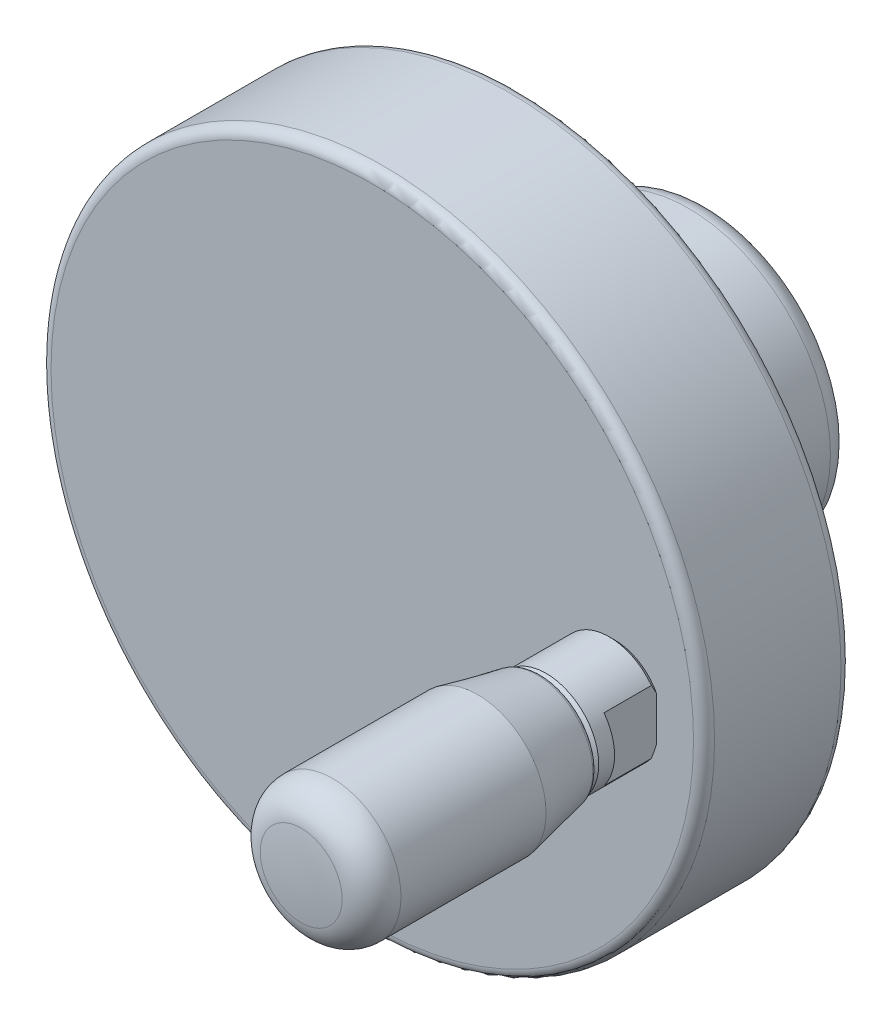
ISO-10303-21;
HEADER;
FILE_DESCRIPTION(('STEP AP214'),'2;1');
FILE_NAME('part.step','',(''),(''),'','','');
FILE_SCHEMA(('AUTOMOTIVE_DESIGN { 1 0 10303 214 1 1 1 1 }'));
ENDSEC;
DATA;
#1=APPLICATION_CONTEXT('core data for automotive mechanical design processes');
#2=APPLICATION_PROTOCOL_DEFINITION('international standard','automotive_design',2000,#1);
#3=PRODUCT_CONTEXT('',#1,'mechanical');
#4=PRODUCT('Part','Part','',(#3));
#5=PRODUCT_RELATED_PRODUCT_CATEGORY('part','',(#4));
#6=PRODUCT_DEFINITION_FORMATION('','',#4);
#7=PRODUCT_DEFINITION_CONTEXT('part definition',#1,'design');
#8=PRODUCT_DEFINITION('design','',#6,#7);
#9=PRODUCT_DEFINITION_SHAPE('','',#8);
#10=(LENGTH_UNIT() NAMED_UNIT(*) SI_UNIT(.MILLI.,.METRE.));
#11=(NAMED_UNIT(*) PLANE_ANGLE_UNIT() SI_UNIT($,.RADIAN.));
#12=(NAMED_UNIT(*) SI_UNIT($,.STERADIAN.) SOLID_ANGLE_UNIT());
#13=UNCERTAINTY_MEASURE_WITH_UNIT(LENGTH_MEASURE(1.E-05),#10,'distance_accuracy_value','');
#14=(GEOMETRIC_REPRESENTATION_CONTEXT(3) GLOBAL_UNCERTAINTY_ASSIGNED_CONTEXT((#13)) GLOBAL_UNIT_ASSIGNED_CONTEXT((#10,
#11,#12)) REPRESENTATION_CONTEXT('',''));
#15=CARTESIAN_POINT('',(0.,0.,0.));
#16=DIRECTION('',(0.,0.,1.));
#17=DIRECTION('',(1.,0.,0.));
#18=AXIS2_PLACEMENT_3D('',#15,#16,#17);
#19=CARTESIAN_POINT('',(0.,6.,22.));
#20=DIRECTION('',(0.,0.,1.));
#21=DIRECTION('',(1.,0.,0.));
#22=AXIS2_PLACEMENT_3D('',#19,#20,#21);
#23=PLANE('',#22);
#24=CARTESIAN_POINT('',(0.,0.,22.));
#25=DIRECTION('',(0.,0.,1.));
#26=DIRECTION('',(1.,0.,0.));
#27=AXIS2_PLACEMENT_3D('',#24,#25,#26);
#28=CIRCLE('',#27,6.);
#29=CARTESIAN_POINT('',(6.,0.,22.));
#30=VERTEX_POINT('',#29);
#31=EDGE_CURVE('E79',#30,#30,#28,.T.);
#32=ORIENTED_EDGE('',*,*,#31,.F.);
#33=EDGE_LOOP('',(#32));
#34=FACE_BOUND('',#33,.T.);
#35=ADVANCED_FACE('F14',(#34),#23,.F.);
#36=CARTESIAN_POINT('',(0.,0.,37.));
#37=DIRECTION('',(0.,0.,1.));
#38=DIRECTION('',(1.,0.,0.));
#39=AXIS2_PLACEMENT_3D('',#36,#37,#38);
#40=CYLINDRICAL_SURFACE('',#39,6.);
#41=CARTESIAN_POINT('',(0.,0.,0.));
#42=DIRECTION('',(0.,0.,1.));
#43=DIRECTION('',(1.,0.,0.));
#44=AXIS2_PLACEMENT_3D('',#41,#42,#43);
#45=CIRCLE('',#44,6.);
#46=CARTESIAN_POINT('',(6.,0.,0.));
#47=VERTEX_POINT('',#46);
#48=EDGE_CURVE('E182',#47,#47,#45,.T.);
#49=ORIENTED_EDGE('',*,*,#48,.F.);
#50=EDGE_LOOP('',(#49));
#51=FACE_BOUND('',#50,.T.);
#52=ORIENTED_EDGE('',*,*,#31,.T.);
#53=EDGE_LOOP('',(#52));
#54=FACE_BOUND('',#53,.T.);
#55=ADVANCED_FACE('F214',(#51,#54),#40,.F.);
#56=CARTESIAN_POINT('',(0.,11.5,0.));
#57=DIRECTION('',(0.,0.,1.));
#58=DIRECTION('',(1.,0.,0.));
#59=AXIS2_PLACEMENT_3D('',#56,#57,#58);
#60=PLANE('',#59);
#61=CARTESIAN_POINT('',(0.,0.,0.));
#62=DIRECTION('',(0.,0.,1.));
#63=DIRECTION('',(1.,0.,0.));
#64=AXIS2_PLACEMENT_3D('',#61,#62,#63);
#65=CIRCLE('',#64,11.5);
#66=CARTESIAN_POINT('',(11.5,0.,0.));
#67=VERTEX_POINT('',#66);
#68=EDGE_CURVE('E179',#67,#67,#65,.T.);
#69=ORIENTED_EDGE('',*,*,#68,.F.);
#70=EDGE_LOOP('',(#69));
#71=FACE_BOUND('',#70,.T.);
#72=ORIENTED_EDGE('',*,*,#48,.T.);
#73=EDGE_LOOP('',(#72));
#74=FACE_BOUND('',#73,.T.);
#75=ADVANCED_FACE('F220',(#71,#74),#60,.F.);
#76=CARTESIAN_POINT('',(0.,0.,2.));
#77=DIRECTION('',(0.,0.,1.));
#78=DIRECTION('',(1.,0.,0.));
#79=AXIS2_PLACEMENT_3D('',#76,#77,#78);
#80=TOROIDAL_SURFACE('',#79,11.5,2.);
#81=CARTESIAN_POINT('',(0.,0.,2.));
#82=DIRECTION('',(0.,0.,1.));
#83=DIRECTION('',(1.,0.,0.));
#84=AXIS2_PLACEMENT_3D('',#81,#82,#83);
#85=CIRCLE('',#84,13.5);
#86=CARTESIAN_POINT('',(13.5,0.,2.));
#87=VERTEX_POINT('',#86);
#88=EDGE_CURVE('E176',#87,#87,#85,.T.);
#89=ORIENTED_EDGE('',*,*,#88,.F.);
#90=EDGE_LOOP('',(#89));
#91=FACE_BOUND('',#90,.T.);
#92=ORIENTED_EDGE('',*,*,#68,.T.);
#93=EDGE_LOOP('',(#92));
#94=FACE_BOUND('',#93,.T.);
#95=ADVANCED_FACE('F228',(#91,#94),#80,.T.);
#96=CARTESIAN_POINT('',(0.,0.,37.));
#97=DIRECTION('',(0.,0.,1.));
#98=DIRECTION('',(1.,0.,0.));
#99=AXIS2_PLACEMENT_3D('',#96,#97,#98);
#100=CYLINDRICAL_SURFACE('',#99,13.5);
#101=CARTESIAN_POINT('',(0.,0.,15.));
#102=DIRECTION('',(0.,0.,1.));
#103=DIRECTION('',(1.,0.,0.));
#104=AXIS2_PLACEMENT_3D('',#101,#102,#103);
#105=CIRCLE('',#104,13.5);
#106=CARTESIAN_POINT('',(13.5,0.,15.));
#107=VERTEX_POINT('',#106);
#108=EDGE_CURVE('E173',#107,#107,#105,.T.);
#109=ORIENTED_EDGE('',*,*,#108,.F.);
#110=EDGE_LOOP('',(#109));
#111=FACE_BOUND('',#110,.T.);
#112=ORIENTED_EDGE('',*,*,#88,.T.);
#113=EDGE_LOOP('',(#112));
#114=FACE_BOUND('',#113,.T.);
#115=ADVANCED_FACE('F235',(#111,#114),#100,.T.);
#116=CARTESIAN_POINT('',(0.,0.,15.));
#117=DIRECTION('',(0.,0.,1.));
#118=DIRECTION('',(1.,0.,0.));
#119=AXIS2_PLACEMENT_3D('',#116,#117,#118);
#120=TOROIDAL_SURFACE('',#119,16.5,3.);
#121=CARTESIAN_POINT('',(0.,0.,18.));
#122=DIRECTION('',(0.,0.,1.));
#123=DIRECTION('',(1.,0.,0.));
#124=AXIS2_PLACEMENT_3D('',#121,#122,#123);
#125=CIRCLE('',#124,16.5);
#126=CARTESIAN_POINT('',(16.5,0.,18.));
#127=VERTEX_POINT('',#126);
#128=EDGE_CURVE('E170',#127,#127,#125,.T.);
#129=ORIENTED_EDGE('',*,*,#128,.F.);
#130=EDGE_LOOP('',(#129));
#131=FACE_BOUND('',#130,.T.);
#132=ORIENTED_EDGE('',*,*,#108,.T.);
#133=EDGE_LOOP('',(#132));
#134=FACE_BOUND('',#133,.T.);
#135=ADVANCED_FACE('F239',(#131,#134),#120,.F.);
#136=CARTESIAN_POINT('',(0.,30.5,18.));
#137=DIRECTION('',(0.,0.,1.));
#138=DIRECTION('',(1.,0.,0.));
#139=AXIS2_PLACEMENT_3D('',#136,#137,#138);
#140=PLANE('',#139);
#141=CARTESIAN_POINT('',(0.,0.,18.));
#142=DIRECTION('',(0.,0.,1.));
#143=DIRECTION('',(1.,0.,0.));
#144=AXIS2_PLACEMENT_3D('',#141,#142,#143);
#145=CIRCLE('',#144,30.5);
#146=CARTESIAN_POINT('',(30.5,0.,18.));
#147=VERTEX_POINT('',#146);
#148=EDGE_CURVE('E167',#147,#147,#145,.T.);
#149=ORIENTED_EDGE('',*,*,#148,.F.);
#150=EDGE_LOOP('',(#149));
#151=FACE_BOUND('',#150,.T.);
#152=ORIENTED_EDGE('',*,*,#128,.T.);
#153=EDGE_LOOP('',(#152));
#154=FACE_BOUND('',#153,.T.);
#155=ADVANCED_FACE('F243',(#151,#154),#140,.F.);
#156=CARTESIAN_POINT('',(0.,0.,19.));
#157=DIRECTION('',(0.,0.,1.));
#158=DIRECTION('',(1.,0.,0.));
#159=AXIS2_PLACEMENT_3D('',#156,#157,#158);
#160=TOROIDAL_SURFACE('',#159,30.5,1.);
#161=CARTESIAN_POINT('',(0.,0.,19.));
#162=DIRECTION('',(0.,0.,1.));
#163=DIRECTION('',(1.,0.,0.));
#164=AXIS2_PLACEMENT_3D('',#161,#162,#163);
#165=CIRCLE('',#164,31.5);
#166=CARTESIAN_POINT('',(31.5,0.,19.));
#167=VERTEX_POINT('',#166);
#168=EDGE_CURVE('E162',#167,#167,#165,.T.);
#169=ORIENTED_EDGE('',*,*,#168,.F.);
#170=EDGE_LOOP('',(#169));
#171=FACE_BOUND('',#170,.T.);
#172=ORIENTED_EDGE('',*,*,#148,.T.);
#173=EDGE_LOOP('',(#172));
#174=FACE_BOUND('',#173,.T.);
#175=ADVANCED_FACE('F247',(#171,#174),#160,.T.);
#176=CARTESIAN_POINT('',(0.,0.,37.));
#177=DIRECTION('',(0.,0.,1.));
#178=DIRECTION('',(1.,0.,0.));
#179=AXIS2_PLACEMENT_3D('',#176,#177,#178);
#180=CYLINDRICAL_SURFACE('',#179,31.5);
#181=CARTESIAN_POINT('',(0.,0.,31.));
#182=DIRECTION('',(0.,0.,1.));
#183=DIRECTION('',(1.,0.,0.));
#184=AXIS2_PLACEMENT_3D('',#181,#182,#183);
#185=CIRCLE('',#184,31.5);
#186=CARTESIAN_POINT('',(31.5,0.,31.));
#187=VERTEX_POINT('',#186);
#188=EDGE_CURVE('E158',#187,#187,#185,.T.);
#189=ORIENTED_EDGE('',*,*,#188,.F.);
#190=EDGE_LOOP('',(#189));
#191=FACE_BOUND('',#190,.T.);
#192=ORIENTED_EDGE('',*,*,#168,.T.);
#193=EDGE_LOOP('',(#192));
#194=FACE_BOUND('',#193,.T.);
#195=ADVANCED_FACE('F251',(#191,#194),#180,.T.);
#196=CARTESIAN_POINT('',(0.,0.,31.));
#197=DIRECTION('',(0.,0.,1.));
#198=DIRECTION('',(1.,0.,0.));
#199=AXIS2_PLACEMENT_3D('',#196,#197,#198);
#200=TOROIDAL_SURFACE('',#199,30.5,1.);
#201=CARTESIAN_POINT('',(0.,0.,32.));
#202=DIRECTION('',(0.,0.,1.));
#203=DIRECTION('',(1.,0.,0.));
#204=AXIS2_PLACEMENT_3D('',#201,#202,#203);
#205=CIRCLE('',#204,30.5);
#206=CARTESIAN_POINT('',(30.5,0.,32.));
#207=VERTEX_POINT('',#206);
#208=EDGE_CURVE('E156',#207,#207,#205,.T.);
#209=ORIENTED_EDGE('',*,*,#208,.F.);
#210=EDGE_LOOP('',(#209));
#211=FACE_BOUND('',#210,.T.);
#212=ORIENTED_EDGE('',*,*,#188,.T.);
#213=EDGE_LOOP('',(#212));
#214=FACE_BOUND('',#213,.T.);
#215=ADVANCED_FACE('F255',(#211,#214),#200,.T.);
#216=CARTESIAN_POINT('',(0.,30.5,32.));
#217=DIRECTION('',(0.,0.,-1.));
#218=DIRECTION('',(-1.,0.,0.));
#219=AXIS2_PLACEMENT_3D('',#216,#217,#218);
#220=PLANE('',#219);
#221=CARTESIAN_POINT('',(23.,0.,32.));
#222=DIRECTION('',(0.,0.,-1.));
#223=DIRECTION('',(0.,1.,0.));
#224=AXIS2_PLACEMENT_3D('',#221,#222,#223);
#225=CIRCLE('',#224,4.5);
#226=CARTESIAN_POINT('',(27.,2.06155281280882,32.));
#227=VERTEX_POINT('',#226);
#228=CARTESIAN_POINT('',(19.,2.06155281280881,32.));
#229=VERTEX_POINT('',#228);
#230=EDGE_CURVE('E24',#227,#229,#225,.F.);
#231=ORIENTED_EDGE('',*,*,#230,.F.);
#232=DIRECTION('',(0.,-1.,0.));
#233=VECTOR('',#232,1.);
#234=CARTESIAN_POINT('',(27.,30.5,32.));
#235=LINE('',#234,#233);
#236=CARTESIAN_POINT('',(27.,-2.06155281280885,32.));
#237=VERTEX_POINT('',#236);
#238=EDGE_CURVE('E9',#227,#237,#235,.T.);
#239=ORIENTED_EDGE('',*,*,#238,.T.);
#240=CARTESIAN_POINT('',(23.,0.,32.));
#241=DIRECTION('',(0.,0.,-1.));
#242=DIRECTION('',(0.,1.,0.));
#243=AXIS2_PLACEMENT_3D('',#240,#241,#242);
#244=CIRCLE('',#243,4.5);
#245=CARTESIAN_POINT('',(19.,-2.06155281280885,32.));
#246=VERTEX_POINT('',#245);
#247=EDGE_CURVE('E71',#246,#237,#244,.F.);
#248=ORIENTED_EDGE('',*,*,#247,.F.);
#249=DIRECTION('',(0.,1.,0.));
#250=VECTOR('',#249,1.);
#251=CARTESIAN_POINT('',(19.,30.5,32.));
#252=LINE('',#251,#250);
#253=EDGE_CURVE('E73',#246,#229,#252,.T.);
#254=ORIENTED_EDGE('',*,*,#253,.T.);
#255=EDGE_LOOP('',(#231,#239,#248,#254));
#256=FACE_BOUND('',#255,.T.);
#257=ORIENTED_EDGE('',*,*,#208,.T.);
#258=EDGE_LOOP('',(#257));
#259=FACE_BOUND('',#258,.T.);
#260=ADVANCED_FACE('F74',(#256,#259),#220,.F.);
#261=CARTESIAN_POINT('',(23.,0.,32.));
#262=DIRECTION('',(0.,0.,1.));
#263=DIRECTION('',(0.,1.,0.));
#264=AXIS2_PLACEMENT_3D('',#261,#262,#263);
#265=SPHERICAL_SURFACE('',#264,30.);
#266=CARTESIAN_POINT('',(23.,0.,61.7468745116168));
#267=DIRECTION('',(0.,0.,1.));
#268=DIRECTION('',(1.,0.,0.));
#269=AXIS2_PLACEMENT_3D('',#266,#267,#268);
#270=CIRCLE('',#269,3.88888888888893);
#271=CARTESIAN_POINT('',(26.8888888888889,0.,61.7468745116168));
#272=VERTEX_POINT('',#271);
#273=EDGE_CURVE('E129',#272,#272,#270,.T.);
#274=ORIENTED_EDGE('',*,*,#273,.T.);
#275=EDGE_LOOP('',(#274));
#276=FACE_BOUND('',#275,.T.);
#277=ADVANCED_FACE('F16',(#276),#265,.T.);
#278=CARTESIAN_POINT('',(23.,0.,58.7721870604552));
#279=DIRECTION('',(0.,0.,1.));
#280=DIRECTION('',(1.,0.,0.));
#281=AXIS2_PLACEMENT_3D('',#278,#279,#280);
#282=TOROIDAL_SURFACE('',#281,3.5,3.);
#283=ORIENTED_EDGE('',*,*,#273,.F.);
#284=EDGE_LOOP('',(#283));
#285=FACE_BOUND('',#284,.T.);
#286=CARTESIAN_POINT('',(23.,0.,58.7721870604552));
#287=DIRECTION('',(0.,0.,1.));
#288=DIRECTION('',(1.,0.,0.));
#289=AXIS2_PLACEMENT_3D('',#286,#287,#288);
#290=CIRCLE('',#289,6.5);
#291=CARTESIAN_POINT('',(29.5,0.,58.7721870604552));
#292=VERTEX_POINT('',#291);
#293=EDGE_CURVE('E132',#292,#292,#290,.T.);
#294=ORIENTED_EDGE('',*,*,#293,.T.);
#295=EDGE_LOOP('',(#294));
#296=FACE_BOUND('',#295,.T.);
#297=ADVANCED_FACE('F201',(#285,#296),#282,.T.);
#298=CARTESIAN_POINT('',(23.,0.,64.5));
#299=DIRECTION('',(0.,0.,1.));
#300=DIRECTION('',(1.,0.,0.));
#301=AXIS2_PLACEMENT_3D('',#298,#299,#300);
#302=CYLINDRICAL_SURFACE('',#301,6.5);
#303=ORIENTED_EDGE('',*,*,#293,.F.);
#304=EDGE_LOOP('',(#303));
#305=FACE_BOUND('',#304,.T.);
#306=CARTESIAN_POINT('',(23.,0.,45.));
#307=DIRECTION('',(0.,0.,1.));
#308=DIRECTION('',(1.,0.,0.));
#309=AXIS2_PLACEMENT_3D('',#306,#307,#308);
#310=CIRCLE('',#309,6.5);
#311=CARTESIAN_POINT('',(29.5,0.,45.));
#312=VERTEX_POINT('',#311);
#313=EDGE_CURVE('E135',#312,#312,#310,.T.);
#314=ORIENTED_EDGE('',*,*,#313,.T.);
#315=EDGE_LOOP('',(#314));
#316=FACE_BOUND('',#315,.T.);
#317=ADVANCED_FACE('F211',(#305,#316),#302,.T.);
#318=CARTESIAN_POINT('',(23.,0.,39.398022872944));
#319=DIRECTION('',(0.,0.,1.));
#320=DIRECTION('',(1.,0.,0.));
#321=AXIS2_PLACEMENT_3D('',#318,#319,#320);
#322=CONICAL_SURFACE('',#321,5.33292143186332,0.20539538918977);
#323=ORIENTED_EDGE('',*,*,#313,.F.);
#324=EDGE_LOOP('',(#323));
#325=FACE_BOUND('',#324,.T.);
#326=CARTESIAN_POINT('',(23.,0.,39.398022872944));
#327=DIRECTION('',(0.,0.,1.));
#328=DIRECTION('',(1.,0.,0.));
#329=AXIS2_PLACEMENT_3D('',#326,#327,#328);
#330=CIRCLE('',#329,5.33292143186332);
#331=CARTESIAN_POINT('',(28.3329214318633,0.,39.398022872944));
#332=VERTEX_POINT('',#331);
#333=EDGE_CURVE('E138',#332,#332,#330,.T.);
#334=ORIENTED_EDGE('',*,*,#333,.T.);
#335=EDGE_LOOP('',(#334));
#336=FACE_BOUND('',#335,.T.);
#337=ADVANCED_FACE('F283',(#325,#336),#322,.T.);
#338=CARTESIAN_POINT('',(23.,0.,39.5));
#339=DIRECTION('',(0.,0.,1.));
#340=DIRECTION('',(1.,0.,0.));
#341=AXIS2_PLACEMENT_3D('',#338,#339,#340);
#342=TOROIDAL_SURFACE('',#341,4.84343122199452,0.500000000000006);
#343=ORIENTED_EDGE('',*,*,#333,.F.);
#344=EDGE_LOOP('',(#343));
#345=FACE_BOUND('',#344,.T.);
#346=CARTESIAN_POINT('',(23.,0.,39.));
#347=DIRECTION('',(0.,0.,1.));
#348=DIRECTION('',(1.,0.,0.));
#349=AXIS2_PLACEMENT_3D('',#346,#347,#348);
#350=CIRCLE('',#349,4.84343122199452);
#351=CARTESIAN_POINT('',(27.8434312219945,0.,39.));
#352=VERTEX_POINT('',#351);
#353=EDGE_CURVE('E141',#352,#352,#350,.T.);
#354=ORIENTED_EDGE('',*,*,#353,.T.);
#355=EDGE_LOOP('',(#354));
#356=FACE_BOUND('',#355,.T.);
#357=ADVANCED_FACE('F279',(#345,#356),#342,.T.);
#358=CARTESIAN_POINT('',(23.,4.84343122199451,39.));
#359=DIRECTION('',(0.,0.,1.));
#360=DIRECTION('',(1.,0.,0.));
#361=AXIS2_PLACEMENT_3D('',#358,#359,#360);
#362=PLANE('',#361);
#363=ORIENTED_EDGE('',*,*,#353,.F.);
#364=EDGE_LOOP('',(#363));
#365=FACE_BOUND('',#364,.T.);
#366=CARTESIAN_POINT('',(23.,0.,39.));
#367=DIRECTION('',(0.,0.,1.));
#368=DIRECTION('',(1.,0.,0.));
#369=AXIS2_PLACEMENT_3D('',#366,#367,#368);
#370=CIRCLE('',#369,4.49999999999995);
#371=CARTESIAN_POINT('',(27.4999999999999,0.,39.));
#372=VERTEX_POINT('',#371);
#373=EDGE_CURVE('E144',#372,#372,#370,.T.);
#374=ORIENTED_EDGE('',*,*,#373,.T.);
#375=EDGE_LOOP('',(#374));
#376=FACE_BOUND('',#375,.T.);
#377=ADVANCED_FACE('F207',(#365,#376),#362,.F.);
#378=CARTESIAN_POINT('',(23.,0.,38.5));
#379=DIRECTION('',(0.,0.,-1.));
#380=DIRECTION('',(-1.,0.,0.));
#381=AXIS2_PLACEMENT_3D('',#378,#379,#380);
#382=CONICAL_SURFACE('',#381,5.,0.785398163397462);
#383=ORIENTED_EDGE('',*,*,#373,.F.);
#384=EDGE_LOOP('',(#383));
#385=FACE_BOUND('',#384,.T.);
#386=CARTESIAN_POINT('',(23.,0.,38.5));
#387=DIRECTION('',(0.,0.,1.));
#388=DIRECTION('',(1.,0.,0.));
#389=AXIS2_PLACEMENT_3D('',#386,#387,#388);
#390=CIRCLE('',#389,5.);
#391=CARTESIAN_POINT('',(28.,0.,38.5));
#392=VERTEX_POINT('',#391);
#393=EDGE_CURVE('E147',#392,#392,#390,.T.);
#394=ORIENTED_EDGE('',*,*,#393,.T.);
#395=EDGE_LOOP('',(#394));
#396=FACE_BOUND('',#395,.T.);
#397=ADVANCED_FACE('F200',(#385,#396),#382,.T.);
#398=CARTESIAN_POINT('',(27.,3.,37.));
#399=DIRECTION('',(0.,0.,1.));
#400=DIRECTION('',(1.,0.,0.));
#401=AXIS2_PLACEMENT_3D('',#398,#399,#400);
#402=PLANE('',#401);
#403=CARTESIAN_POINT('',(23.,0.,37.));
#404=DIRECTION('',(0.,0.,1.));
#405=DIRECTION('',(1.,0.,0.));
#406=AXIS2_PLACEMENT_3D('',#403,#404,#405);
#407=CIRCLE('',#406,5.);
#408=CARTESIAN_POINT('',(27.,-3.,37.));
#409=VERTEX_POINT('',#408);
#410=CARTESIAN_POINT('',(27.,3.,37.));
#411=VERTEX_POINT('',#410);
#412=EDGE_CURVE('E153',#409,#411,#407,.T.);
#413=ORIENTED_EDGE('',*,*,#412,.F.);
#414=DIRECTION('',(0.,-1.,0.));
#415=VECTOR('',#414,1.);
#416=CARTESIAN_POINT('',(27.,3.,37.));
#417=LINE('',#416,#415);
#418=EDGE_CURVE('E61',#411,#409,#417,.T.);
#419=ORIENTED_EDGE('',*,*,#418,.F.);
#420=EDGE_LOOP('',(#413,#419));
#421=FACE_BOUND('',#420,.T.);
#422=ADVANCED_FACE('F117',(#421),#402,.F.);
#423=CARTESIAN_POINT('',(19.,3.,37.));
#424=DIRECTION('',(0.,0.,-1.));
#425=DIRECTION('',(-1.,0.,0.));
#426=AXIS2_PLACEMENT_3D('',#423,#424,#425);
#427=PLANE('',#426);
#428=CARTESIAN_POINT('',(23.,0.,37.));
#429=DIRECTION('',(0.,0.,-1.));
#430=DIRECTION('',(-1.,0.,0.));
#431=AXIS2_PLACEMENT_3D('',#428,#429,#430);
#432=CIRCLE('',#431,5.);
#433=CARTESIAN_POINT('',(19.,-3.,37.));
#434=VERTEX_POINT('',#433);
#435=CARTESIAN_POINT('',(19.,2.99999999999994,37.));
#436=VERTEX_POINT('',#435);
#437=EDGE_CURVE('E67',#434,#436,#432,.T.);
#438=ORIENTED_EDGE('',*,*,#437,.T.);
#439=DIRECTION('',(0.,-1.,0.));
#440=VECTOR('',#439,1.);
#441=CARTESIAN_POINT('',(19.,3.,37.));
#442=LINE('',#441,#440);
#443=EDGE_CURVE('E187',#436,#434,#442,.T.);
#444=ORIENTED_EDGE('',*,*,#443,.T.);
#445=EDGE_LOOP('',(#438,#444));
#446=FACE_BOUND('',#445,.T.);
#447=ADVANCED_FACE('F112',(#446),#427,.T.);
#448=CARTESIAN_POINT('',(23.,0.,64.5));
#449=DIRECTION('',(0.,0.,1.));
#450=DIRECTION('',(1.,0.,0.));
#451=AXIS2_PLACEMENT_3D('',#448,#449,#450);
#452=CYLINDRICAL_SURFACE('',#451,5.);
#453=ORIENTED_EDGE('',*,*,#393,.F.);
#454=EDGE_LOOP('',(#453));
#455=FACE_BOUND('',#454,.T.);
#456=DIRECTION('',(0.,0.,1.));
#457=VECTOR('',#456,1.);
#458=CARTESIAN_POINT('',(19.,2.99999999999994,64.5));
#459=LINE('',#458,#457);
#460=CARTESIAN_POINT('',(19.,3.,32.5));
#461=VERTEX_POINT('',#460);
#462=EDGE_CURVE('E18',#436,#461,#459,.F.);
#463=ORIENTED_EDGE('',*,*,#462,.F.);
#464=ORIENTED_EDGE('',*,*,#437,.F.);
#465=DIRECTION('',(0.,0.,-1.));
#466=VECTOR('',#465,1.);
#467=CARTESIAN_POINT('',(19.,-3.,32.));
#468=LINE('',#467,#466);
#469=CARTESIAN_POINT('',(19.,-3.,32.5));
#470=VERTEX_POINT('',#469);
#471=EDGE_CURVE('E96',#434,#470,#468,.T.);
#472=ORIENTED_EDGE('',*,*,#471,.T.);
#473=CARTESIAN_POINT('',(23.,0.,32.5));
#474=DIRECTION('',(0.,0.,1.));
#475=DIRECTION('',(1.,0.,0.));
#476=AXIS2_PLACEMENT_3D('',#473,#474,#475);
#477=CIRCLE('',#476,5.);
#478=CARTESIAN_POINT('',(27.,-3.,32.5));
#479=VERTEX_POINT('',#478);
#480=EDGE_CURVE('E150',#470,#479,#477,.T.);
#481=ORIENTED_EDGE('',*,*,#480,.T.);
#482=DIRECTION('',(0.,0.,-1.));
#483=VECTOR('',#482,1.);
#484=CARTESIAN_POINT('',(27.,-3.,37.));
#485=LINE('',#484,#483);
#486=EDGE_CURVE('E94',#409,#479,#485,.T.);
#487=ORIENTED_EDGE('',*,*,#486,.F.);
#488=ORIENTED_EDGE('',*,*,#412,.T.);
#489=DIRECTION('',(0.,0.,1.));
#490=VECTOR('',#489,1.);
#491=CARTESIAN_POINT('',(27.,2.99999999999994,64.5));
#492=LINE('',#491,#490);
#493=CARTESIAN_POINT('',(27.,3.,32.5));
#494=VERTEX_POINT('',#493);
#495=EDGE_CURVE('E155',#494,#411,#492,.T.);
#496=ORIENTED_EDGE('',*,*,#495,.F.);
#497=EDGE_CURVE('E151',#494,#461,#477,.T.);
#498=ORIENTED_EDGE('',*,*,#497,.T.);
#499=EDGE_LOOP('',(#463,#464,#472,#481,#487,#488,#496,#498));
#500=FACE_BOUND('',#499,.T.);
#501=ADVANCED_FACE('F116',(#455,#500),#452,.T.);
#502=CARTESIAN_POINT('',(23.,0.,32.));
#503=DIRECTION('',(0.,0.,1.));
#504=DIRECTION('',(1.,0.,0.));
#505=AXIS2_PLACEMENT_3D('',#502,#503,#504);
#506=CONICAL_SURFACE('',#505,4.5,0.785398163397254);
#507=CARTESIAN_POINT('',(19.,6.61267837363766,35.2283578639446));
#508=CARTESIAN_POINT('',(19.,6.5138484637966,35.1437976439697));
#509=CARTESIAN_POINT('',(19.,6.41477027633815,35.0595275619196));
#510=CARTESIAN_POINT('',(19.,6.21605204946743,34.8916487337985));
#511=CARTESIAN_POINT('',(19.,6.11641199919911,34.8080400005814));
#512=CARTESIAN_POINT('',(19.,5.81645670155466,34.5582489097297));
#513=CARTESIAN_POINT('',(19.,5.61520522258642,34.3931865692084));
#514=CARTESIAN_POINT('',(19.,5.20414443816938,34.0626045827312));
#515=CARTESIAN_POINT('',(19.,4.99425007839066,33.8971902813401));
#516=CARTESIAN_POINT('',(19.,4.57024237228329,33.5719522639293));
#517=CARTESIAN_POINT('',(19.,4.35613010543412,33.4121271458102));
#518=CARTESIAN_POINT('',(19.,3.92191769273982,33.0998698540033));
#519=CARTESIAN_POINT('',(19.,3.70180729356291,32.9474517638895));
#520=CARTESIAN_POINT('',(19.,3.36602267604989,32.7271432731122));
#521=CARTESIAN_POINT('',(19.,3.25310127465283,32.655060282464));
#522=CARTESIAN_POINT('',(19.,3.02514651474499,32.514324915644));
#523=CARTESIAN_POINT('',(19.,2.91011332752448,32.4456722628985));
#524=CARTESIAN_POINT('',(19.,2.67874926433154,32.3131895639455));
#525=CARTESIAN_POINT('',(19.,2.56244159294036,32.2493194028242));
#526=CARTESIAN_POINT('',(19.,2.32719948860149,32.1266386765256));
#527=CARTESIAN_POINT('',(19.,2.2082647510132,32.0678287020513));
#528=CARTESIAN_POINT('',(19.,1.847452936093,31.9008663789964));
#529=CARTESIAN_POINT('',(19.,1.60104963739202,31.8018732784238));
#530=CARTESIAN_POINT('',(19.,1.21869368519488,31.6797214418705));
#531=CARTESIAN_POINT('',(19.,1.08703991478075,31.6430541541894));
#532=CARTESIAN_POINT('',(19.,0.820997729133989,31.5813368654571));
#533=CARTESIAN_POINT('',(19.,0.686609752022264,31.556285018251));
#534=CARTESIAN_POINT('',(19.,0.416637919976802,31.5194288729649));
#535=CARTESIAN_POINT('',(19.,0.281062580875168,31.5075632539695));
#536=CARTESIAN_POINT('',(19.,0.00940161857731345,31.4977080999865));
#537=CARTESIAN_POINT('',(19.,-0.126683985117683,31.4997180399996));
#538=CARTESIAN_POINT('',(19.,-0.39769597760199,31.5174494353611));
#539=CARTESIAN_POINT('',(19.,-0.532623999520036,31.5331464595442));
#540=CARTESIAN_POINT('',(19.,-0.800390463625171,31.5771511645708));
#541=CARTESIAN_POINT('',(19.,-0.933228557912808,31.6054609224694));
#542=CARTESIAN_POINT('',(19.,-1.19683850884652,31.6732578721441));
#543=CARTESIAN_POINT('',(19.,-1.32759286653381,31.712812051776));
#544=CARTESIAN_POINT('',(19.,-1.58587707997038,31.8011944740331));
#545=CARTESIAN_POINT('',(19.,-1.71340705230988,31.8500223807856));
#546=CARTESIAN_POINT('',(19.,-2.00607339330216,31.9722871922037));
#547=CARTESIAN_POINT('',(19.,-2.17001221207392,32.0485725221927));
#548=CARTESIAN_POINT('',(19.,-2.49288824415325,32.2111596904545));
#549=CARTESIAN_POINT('',(19.,-2.65182228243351,32.2974677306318));
#550=CARTESIAN_POINT('',(19.,-2.96566951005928,32.4778181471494));
#551=CARTESIAN_POINT('',(19.,-3.12057308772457,32.5718771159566));
#552=CARTESIAN_POINT('',(19.,-3.42666836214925,32.7657420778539));
#553=CARTESIAN_POINT('',(19.,-3.57786085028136,32.8655468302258));
#554=CARTESIAN_POINT('',(19.,-3.87789023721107,33.0700932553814));
#555=CARTESIAN_POINT('',(19.,-4.02671282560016,33.1748558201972));
#556=CARTESIAN_POINT('',(19.,-4.32180408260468,33.3879178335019));
#557=CARTESIAN_POINT('',(19.,-4.46807264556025,33.496217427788));
#558=CARTESIAN_POINT('',(19.,-4.75830471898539,33.7154998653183));
#559=CARTESIAN_POINT('',(19.,-4.90227076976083,33.8264793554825));
#560=CARTESIAN_POINT('',(19.,-5.18842229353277,34.050713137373));
#561=CARTESIAN_POINT('',(19.,-5.33060772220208,34.1639674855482));
#562=CARTESIAN_POINT('',(19.,-5.66527129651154,34.4341347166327));
#563=CARTESIAN_POINT('',(19.,-5.85710121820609,34.5918491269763));
#564=CARTESIAN_POINT('',(19.,-6.23712174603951,34.9088482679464));
#565=CARTESIAN_POINT('',(19.,-6.42532862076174,35.0681134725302));
#566=CARTESIAN_POINT('',(19.,-6.61267837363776,35.2283578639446));
#567=B_SPLINE_CURVE_WITH_KNOTS('',3,(#507,#508,#509,#510,#511,#512,#513,#514,#515,#516,#517,
#518,#519,#520,#521,#522,#523,#524,#525,#526,#527,#528,#529,#530,#531,#532,#533,#534,#535,#536,
#537,#538,#539,#540,#541,#542,#543,#544,#545,#546,#547,#548,#549,#550,#551,#552,#553,#554,#555,
#556,#557,#558,#559,#560,#561,#562,#563,#564,#565,#566),.UNSPECIFIED.,.F.,.F.,(4,2,2,2,2,2,2,2,
2,2,2,2,2,2,2,2,2,2,2,2,2,2,2,2,2,2,2,2,2,4),(0.,0.390204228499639,0.780416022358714,
1.5612306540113,2.36288213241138,3.16433104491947,3.96724854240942,4.36910117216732,
4.77092134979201,5.16886742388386,5.56685988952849,6.36104037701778,6.77061720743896,
7.18012891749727,7.58772816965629,7.99531199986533,8.402169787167,8.80909460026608,
9.21849635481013,9.62788328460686,10.1698609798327,10.7121758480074,11.2556834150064,
11.7990740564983,12.3450041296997,12.8909567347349,13.4362584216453,13.9815736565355,
14.7265631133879,15.4661801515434),.UNSPECIFIED.);
#568=EDGE_CURVE('E92',#246,#470,#567,.T.);
#569=ORIENTED_EDGE('',*,*,#568,.F.);
#570=ORIENTED_EDGE('',*,*,#247,.T.);
#571=CARTESIAN_POINT('',(27.,-6.61267837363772,35.2283578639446));
#572=CARTESIAN_POINT('',(27.,-6.51384846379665,35.1437976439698));
#573=CARTESIAN_POINT('',(27.,-6.4147702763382,35.0595275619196));
#574=CARTESIAN_POINT('',(27.,-6.21605204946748,34.8916487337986));
#575=CARTESIAN_POINT('',(27.,-6.11641199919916,34.8080400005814));
#576=CARTESIAN_POINT('',(27.,-5.81645670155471,34.5582489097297));
#577=CARTESIAN_POINT('',(27.,-5.61520522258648,34.3931865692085));
#578=CARTESIAN_POINT('',(27.,-5.20414443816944,34.0626045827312));
#579=CARTESIAN_POINT('',(27.,-4.99425007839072,33.8971902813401));
#580=CARTESIAN_POINT('',(27.,-4.57024237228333,33.5719522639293));
#581=CARTESIAN_POINT('',(27.,-4.35613010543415,33.4121271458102));
#582=CARTESIAN_POINT('',(27.,-3.92191769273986,33.0998698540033));
#583=CARTESIAN_POINT('',(27.,-3.70180729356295,32.9474517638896));
#584=CARTESIAN_POINT('',(27.,-3.36602267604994,32.7271432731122));
#585=CARTESIAN_POINT('',(27.,-3.25310127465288,32.655060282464));
#586=CARTESIAN_POINT('',(27.,-3.02514651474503,32.514324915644));
#587=CARTESIAN_POINT('',(27.,-2.91011332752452,32.4456722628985));
#588=CARTESIAN_POINT('',(27.,-2.67874926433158,32.3131895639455));
#589=CARTESIAN_POINT('',(27.,-2.5624415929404,32.2493194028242));
#590=CARTESIAN_POINT('',(27.,-2.32719948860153,32.1266386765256));
#591=CARTESIAN_POINT('',(27.,-2.20826475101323,32.0678287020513));
#592=CARTESIAN_POINT('',(27.,-1.84745293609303,31.9008663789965));
#593=CARTESIAN_POINT('',(27.,-1.60104963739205,31.8018732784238));
#594=CARTESIAN_POINT('',(27.,-1.2186936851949,31.6797214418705));
#595=CARTESIAN_POINT('',(27.,-1.08703991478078,31.6430541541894));
#596=CARTESIAN_POINT('',(27.,-0.820997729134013,31.5813368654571));
#597=CARTESIAN_POINT('',(27.,-0.686609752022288,31.556285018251));
#598=CARTESIAN_POINT('',(27.,-0.416637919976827,31.5194288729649));
#599=CARTESIAN_POINT('',(27.,-0.281062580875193,31.5075632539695));
#600=CARTESIAN_POINT('',(27.,-0.009401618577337,31.4977080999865));
#601=CARTESIAN_POINT('',(27.,0.12668398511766,31.4997180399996));
#602=CARTESIAN_POINT('',(27.,0.397695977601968,31.5174494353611));
#603=CARTESIAN_POINT('',(27.,0.532623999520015,31.5331464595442));
#604=CARTESIAN_POINT('',(27.,0.800390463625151,31.5771511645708));
#605=CARTESIAN_POINT('',(27.,0.933228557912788,31.6054609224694));
#606=CARTESIAN_POINT('',(27.,1.19683850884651,31.6732578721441));
#607=CARTESIAN_POINT('',(27.,1.32759286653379,31.712812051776));
#608=CARTESIAN_POINT('',(27.,1.58587707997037,31.8011944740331));
#609=CARTESIAN_POINT('',(27.,1.71340705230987,31.8500223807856));
#610=CARTESIAN_POINT('',(27.,2.00607339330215,31.9722871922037));
#611=CARTESIAN_POINT('',(27.,2.1700122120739,32.0485725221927));
#612=CARTESIAN_POINT('',(27.,2.49288824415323,32.2111596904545));
#613=CARTESIAN_POINT('',(27.,2.6518222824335,32.2974677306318));
#614=CARTESIAN_POINT('',(27.,2.96566951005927,32.4778181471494));
#615=CARTESIAN_POINT('',(27.,3.12057308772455,32.5718771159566));
#616=CARTESIAN_POINT('',(27.,3.42666836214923,32.7657420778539));
#617=CARTESIAN_POINT('',(27.,3.57786085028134,32.8655468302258));
#618=CARTESIAN_POINT('',(27.,3.87789023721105,33.0700932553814));
#619=CARTESIAN_POINT('',(27.,4.02671282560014,33.1748558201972));
#620=CARTESIAN_POINT('',(27.,4.32180408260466,33.3879178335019));
#621=CARTESIAN_POINT('',(27.,4.46807264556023,33.496217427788));
#622=CARTESIAN_POINT('',(27.,4.75830471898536,33.7154998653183));
#623=CARTESIAN_POINT('',(27.,4.9022707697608,33.8264793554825));
#624=CARTESIAN_POINT('',(27.,5.18842229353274,34.050713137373));
#625=CARTESIAN_POINT('',(27.,5.33060772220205,34.1639674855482));
#626=CARTESIAN_POINT('',(27.,5.6652712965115,34.4341347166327));
#627=CARTESIAN_POINT('',(27.,5.85710121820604,34.5918491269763));
#628=CARTESIAN_POINT('',(27.,6.23712174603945,34.9088482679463));
#629=CARTESIAN_POINT('',(27.,6.42532862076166,35.0681134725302));
#630=CARTESIAN_POINT('',(27.,6.61267837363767,35.2283578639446));
#631=B_SPLINE_CURVE_WITH_KNOTS('',3,(#571,#572,#573,#574,#575,#576,#577,#578,#579,#580,#581,
#582,#583,#584,#585,#586,#587,#588,#589,#590,#591,#592,#593,#594,#595,#596,#597,#598,#599,#600,
#601,#602,#603,#604,#605,#606,#607,#608,#609,#610,#611,#612,#613,#614,#615,#616,#617,#618,#619,
#620,#621,#622,#623,#624,#625,#626,#627,#628,#629,#630),.UNSPECIFIED.,.F.,.F.,(4,2,2,2,2,2,2,2,
2,2,2,2,2,2,2,2,2,2,2,2,2,2,2,2,2,2,2,2,2,4),(0.,0.390204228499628,0.780416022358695,
1.56123065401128,2.36288213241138,3.16433104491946,3.96724854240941,4.36910117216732,
4.77092134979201,5.16886742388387,5.5668598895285,6.3610403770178,6.77061720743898,
7.1801289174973,7.58772816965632,7.99531199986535,8.40216978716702,8.80909460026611,
9.21849635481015,9.62788328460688,10.1698609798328,10.7121758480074,11.2556834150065,
11.7990740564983,12.3450041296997,12.8909567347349,13.4362584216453,13.9815736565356,
14.7265631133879,15.4661801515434),.UNSPECIFIED.);
#632=EDGE_CURVE('E128',#479,#237,#631,.T.);
#633=ORIENTED_EDGE('',*,*,#632,.F.);
#634=ORIENTED_EDGE('',*,*,#480,.F.);
#635=EDGE_LOOP('',(#569,#570,#633,#634));
#636=FACE_BOUND('',#635,.T.);
#637=ADVANCED_FACE('F195',(#636),#506,.T.);
#638=EDGE_CURVE('E86',#461,#229,#567,.T.);
#639=ORIENTED_EDGE('',*,*,#638,.F.);
#640=ORIENTED_EDGE('',*,*,#497,.F.);
#641=EDGE_CURVE('E88',#227,#494,#631,.T.);
#642=ORIENTED_EDGE('',*,*,#641,.F.);
#643=ORIENTED_EDGE('',*,*,#230,.T.);
#644=EDGE_LOOP('',(#639,#640,#642,#643));
#645=FACE_BOUND('',#644,.T.);
#646=ADVANCED_FACE('F84',(#645),#506,.T.);
#647=CARTESIAN_POINT('',(19.,3.,32.));
#648=DIRECTION('',(-1.,0.,0.));
#649=DIRECTION('',(0.,0.,1.));
#650=AXIS2_PLACEMENT_3D('',#647,#648,#649);
#651=PLANE('',#650);
#652=ORIENTED_EDGE('',*,*,#638,.T.);
#653=ORIENTED_EDGE('',*,*,#253,.F.);
#654=ORIENTED_EDGE('',*,*,#568,.T.);
#655=ORIENTED_EDGE('',*,*,#471,.F.);
#656=ORIENTED_EDGE('',*,*,#443,.F.);
#657=ORIENTED_EDGE('',*,*,#462,.T.);
#658=EDGE_LOOP('',(#652,#653,#654,#655,#656,#657));
#659=FACE_BOUND('',#658,.T.);
#660=ADVANCED_FACE('F90',(#659),#651,.T.);
#661=CARTESIAN_POINT('',(27.,-3.,37.));
#662=DIRECTION('',(1.,0.,0.));
#663=DIRECTION('',(0.,0.,-1.));
#664=AXIS2_PLACEMENT_3D('',#661,#662,#663);
#665=PLANE('',#664);
#666=ORIENTED_EDGE('',*,*,#632,.T.);
#667=ORIENTED_EDGE('',*,*,#238,.F.);
#668=ORIENTED_EDGE('',*,*,#641,.T.);
#669=ORIENTED_EDGE('',*,*,#495,.T.);
#670=ORIENTED_EDGE('',*,*,#418,.T.);
#671=ORIENTED_EDGE('',*,*,#486,.T.);
#672=EDGE_LOOP('',(#666,#667,#668,#669,#670,#671));
#673=FACE_BOUND('',#672,.T.);
#674=ADVANCED_FACE('F111',(#673),#665,.T.);
#675=CLOSED_SHELL('',(#35,#55,#75,#95,#115,#135,#155,#175,#195,#215,#260,#277,#297,#317,#337,
#357,#377,#397,#422,#447,#501,#637,#646,#660,#674));
#676=MANIFOLD_SOLID_BREP('B1',#675);
#677=ADVANCED_BREP_SHAPE_REPRESENTATION('',(#18,#676),#14);
#678=SHAPE_DEFINITION_REPRESENTATION(#9,#677);
ENDSEC;
END-ISO-10303-21;
